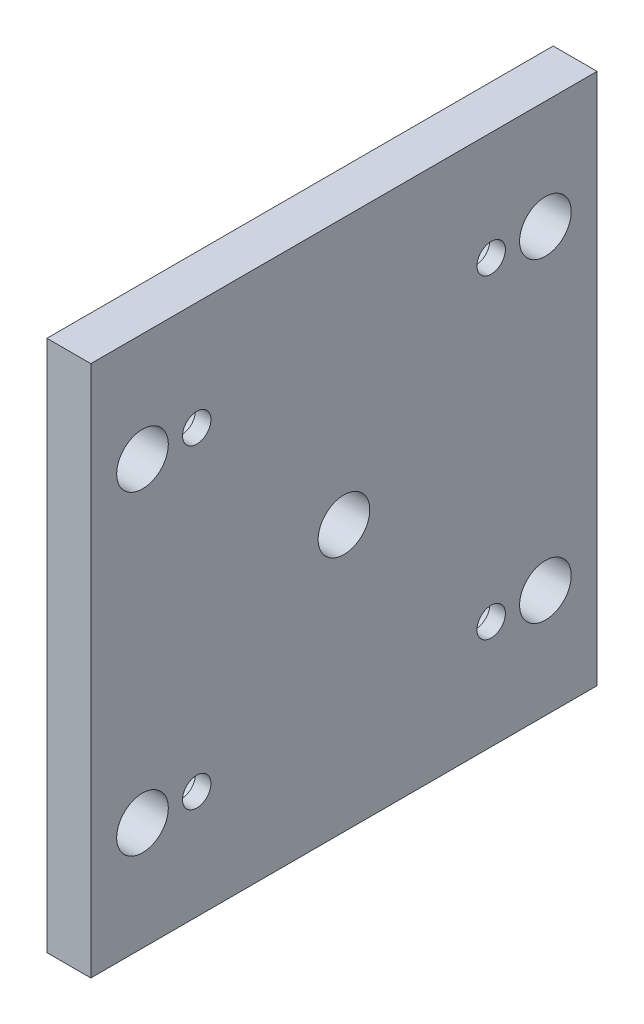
ISO-10303-21;
HEADER;
FILE_DESCRIPTION(('STEP AP214'),'2;1');
FILE_NAME('part.step','',(''),(''),'','','');
FILE_SCHEMA(('AUTOMOTIVE_DESIGN { 1 0 10303 214 1 1 1 1 }'));
ENDSEC;
DATA;
#1=APPLICATION_CONTEXT('core data for automotive mechanical design processes');
#2=APPLICATION_PROTOCOL_DEFINITION('international standard','automotive_design',2000,#1);
#3=PRODUCT_CONTEXT('',#1,'mechanical');
#4=PRODUCT('Part','Part','',(#3));
#5=PRODUCT_RELATED_PRODUCT_CATEGORY('part','',(#4));
#6=PRODUCT_DEFINITION_FORMATION('','',#4);
#7=PRODUCT_DEFINITION_CONTEXT('part definition',#1,'design');
#8=PRODUCT_DEFINITION('design','',#6,#7);
#9=PRODUCT_DEFINITION_SHAPE('','',#8);
#10=(LENGTH_UNIT() NAMED_UNIT(*) SI_UNIT(.MILLI.,.METRE.));
#11=(NAMED_UNIT(*) PLANE_ANGLE_UNIT() SI_UNIT($,.RADIAN.));
#12=(NAMED_UNIT(*) SI_UNIT($,.STERADIAN.) SOLID_ANGLE_UNIT());
#13=UNCERTAINTY_MEASURE_WITH_UNIT(LENGTH_MEASURE(1.E-05),#10,'distance_accuracy_value','');
#14=(GEOMETRIC_REPRESENTATION_CONTEXT(3) GLOBAL_UNCERTAINTY_ASSIGNED_CONTEXT((#13)) GLOBAL_UNIT_ASSIGNED_CONTEXT((#10,
#11,#12)) REPRESENTATION_CONTEXT('',''));
#15=CARTESIAN_POINT('',(0.,0.,0.));
#16=DIRECTION('',(0.,0.,1.));
#17=DIRECTION('',(1.,0.,0.));
#18=AXIS2_PLACEMENT_3D('',#15,#16,#17);
#19=CARTESIAN_POINT('',(-165.,78.,98.0000000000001));
#20=DIRECTION('',(-1.,0.,0.));
#21=DIRECTION('',(0.,0.,1.));
#22=AXIS2_PLACEMENT_3D('',#19,#20,#21);
#23=PLANE('',#22);
#24=CARTESIAN_POINT('',(-165.,78.,98.0000000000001));
#25=DIRECTION('',(-1.,0.,0.));
#26=DIRECTION('',(0.,0.,1.));
#27=AXIS2_PLACEMENT_3D('',#24,#25,#26);
#28=CIRCLE('',#27,9.99999999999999);
#29=CARTESIAN_POINT('',(-165.,78.,108.));
#30=VERTEX_POINT('',#29);
#31=EDGE_CURVE('E100',#30,#30,#28,.T.);
#32=ORIENTED_EDGE('',*,*,#31,.F.);
#33=EDGE_LOOP('',(#32));
#34=FACE_BOUND('',#33,.T.);
#35=CARTESIAN_POINT('',(-165.,139.,155.));
#36=DIRECTION('',(-1.,0.,0.));
#37=DIRECTION('',(0.,0.,1.));
#38=AXIS2_PLACEMENT_3D('',#35,#36,#37);
#39=CIRCLE('',#38,9.);
#40=CARTESIAN_POINT('',(-165.,139.,164.));
#41=VERTEX_POINT('',#40);
#42=EDGE_CURVE('E31',#41,#41,#39,.T.);
#43=ORIENTED_EDGE('',*,*,#42,.F.);
#44=EDGE_LOOP('',(#43));
#45=FACE_BOUND('',#44,.T.);
#46=CARTESIAN_POINT('',(-165.,139.,41.0000000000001));
#47=DIRECTION('',(-1.,0.,0.));
#48=DIRECTION('',(0.,0.,1.));
#49=AXIS2_PLACEMENT_3D('',#46,#47,#48);
#50=CIRCLE('',#49,9.);
#51=CARTESIAN_POINT('',(-165.,139.,50.0000000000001));
#52=VERTEX_POINT('',#51);
#53=EDGE_CURVE('E127',#52,#52,#50,.T.);
#54=ORIENTED_EDGE('',*,*,#53,.F.);
#55=EDGE_LOOP('',(#54));
#56=FACE_BOUND('',#55,.T.);
#57=CARTESIAN_POINT('',(-165.,17.,155.));
#58=DIRECTION('',(-1.,0.,0.));
#59=DIRECTION('',(0.,0.,1.));
#60=AXIS2_PLACEMENT_3D('',#57,#58,#59);
#61=CIRCLE('',#60,9.);
#62=CARTESIAN_POINT('',(-165.,17.,164.));
#63=VERTEX_POINT('',#62);
#64=EDGE_CURVE('E135',#63,#63,#61,.T.);
#65=ORIENTED_EDGE('',*,*,#64,.F.);
#66=EDGE_LOOP('',(#65));
#67=FACE_BOUND('',#66,.T.);
#68=CARTESIAN_POINT('',(-165.,17.,41.));
#69=DIRECTION('',(-1.,0.,0.));
#70=DIRECTION('',(0.,0.,1.));
#71=AXIS2_PLACEMENT_3D('',#68,#69,#70);
#72=CIRCLE('',#71,9.);
#73=CARTESIAN_POINT('',(-165.,17.,50.));
#74=VERTEX_POINT('',#73);
#75=EDGE_CURVE('E162',#74,#74,#72,.T.);
#76=ORIENTED_EDGE('',*,*,#75,.F.);
#77=EDGE_LOOP('',(#76));
#78=FACE_BOUND('',#77,.T.);
#79=CARTESIAN_POINT('',(-165.,139.,176.));
#80=DIRECTION('',(-1.,0.,0.));
#81=DIRECTION('',(0.,0.,1.));
#82=AXIS2_PLACEMENT_3D('',#79,#80,#81);
#83=CIRCLE('',#82,10.);
#84=CARTESIAN_POINT('',(-165.,139.,186.));
#85=VERTEX_POINT('',#84);
#86=EDGE_CURVE('E136',#85,#85,#83,.T.);
#87=ORIENTED_EDGE('',*,*,#86,.F.);
#88=EDGE_LOOP('',(#87));
#89=FACE_BOUND('',#88,.T.);
#90=CARTESIAN_POINT('',(-165.,139.,20.0000000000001));
#91=DIRECTION('',(-1.,0.,0.));
#92=DIRECTION('',(0.,0.,1.));
#93=AXIS2_PLACEMENT_3D('',#90,#91,#92);
#94=CIRCLE('',#93,10.);
#95=CARTESIAN_POINT('',(-165.,139.,30.0000000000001));
#96=VERTEX_POINT('',#95);
#97=EDGE_CURVE('E141',#96,#96,#94,.T.);
#98=ORIENTED_EDGE('',*,*,#97,.F.);
#99=EDGE_LOOP('',(#98));
#100=FACE_BOUND('',#99,.T.);
#101=CARTESIAN_POINT('',(-165.,17.,176.));
#102=DIRECTION('',(-1.,0.,0.));
#103=DIRECTION('',(0.,0.,1.));
#104=AXIS2_PLACEMENT_3D('',#101,#102,#103);
#105=CIRCLE('',#104,10.);
#106=CARTESIAN_POINT('',(-165.,17.,186.));
#107=VERTEX_POINT('',#106);
#108=EDGE_CURVE('E145',#107,#107,#105,.T.);
#109=ORIENTED_EDGE('',*,*,#108,.F.);
#110=EDGE_LOOP('',(#109));
#111=FACE_BOUND('',#110,.T.);
#112=CARTESIAN_POINT('',(-165.,17.,20.));
#113=DIRECTION('',(-1.,0.,0.));
#114=DIRECTION('',(0.,0.,1.));
#115=AXIS2_PLACEMENT_3D('',#112,#113,#114);
#116=CIRCLE('',#115,10.);
#117=CARTESIAN_POINT('',(-165.,17.,30.));
#118=VERTEX_POINT('',#117);
#119=EDGE_CURVE('E149',#118,#118,#116,.T.);
#120=ORIENTED_EDGE('',*,*,#119,.F.);
#121=EDGE_LOOP('',(#120));
#122=FACE_BOUND('',#121,.T.);
#123=DIRECTION('',(0.,1.,0.));
#124=VECTOR('',#123,1.);
#125=CARTESIAN_POINT('',(-165.,78.,0.));
#126=LINE('',#125,#124);
#127=CARTESIAN_POINT('',(-165.,-25.,0.));
#128=VERTEX_POINT('',#127);
#129=CARTESIAN_POINT('',(-165.,181.,0.));
#130=VERTEX_POINT('',#129);
#131=EDGE_CURVE('E11',#128,#130,#126,.T.);
#132=ORIENTED_EDGE('',*,*,#131,.F.);
#133=DIRECTION('',(0.,0.,-1.));
#134=VECTOR('',#133,1.);
#135=CARTESIAN_POINT('',(-165.,-25.0000000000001,196.));
#136=LINE('',#135,#134);
#137=CARTESIAN_POINT('',(-165.,-25.0000000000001,196.));
#138=VERTEX_POINT('',#137);
#139=EDGE_CURVE('E82',#138,#128,#136,.T.);
#140=ORIENTED_EDGE('',*,*,#139,.F.);
#141=DIRECTION('',(0.,-1.,0.));
#142=VECTOR('',#141,1.);
#143=CARTESIAN_POINT('',(-165.,78.,196.));
#144=LINE('',#143,#142);
#145=CARTESIAN_POINT('',(-165.,181.,196.));
#146=VERTEX_POINT('',#145);
#147=EDGE_CURVE('E36',#146,#138,#144,.T.);
#148=ORIENTED_EDGE('',*,*,#147,.F.);
#149=DIRECTION('',(0.,0.,1.));
#150=VECTOR('',#149,1.);
#151=CARTESIAN_POINT('',(-165.,181.,0.));
#152=LINE('',#151,#150);
#153=EDGE_CURVE('E96',#130,#146,#152,.T.);
#154=ORIENTED_EDGE('',*,*,#153,.F.);
#155=EDGE_LOOP('',(#132,#140,#148,#154));
#156=FACE_BOUND('',#155,.T.);
#157=ADVANCED_FACE('F28',(#34,#45,#56,#67,#78,#89,#100,#111,#122,#156),#23,.T.);
#158=CARTESIAN_POINT('',(-148.,78.,0.));
#159=DIRECTION('',(0.,0.,-1.));
#160=DIRECTION('',(-1.,0.,0.));
#161=AXIS2_PLACEMENT_3D('',#158,#159,#160);
#162=PLANE('',#161);
#163=DIRECTION('',(0.,-1.,0.));
#164=VECTOR('',#163,1.);
#165=CARTESIAN_POINT('',(-148.,78.,0.));
#166=LINE('',#165,#164);
#167=CARTESIAN_POINT('',(-148.,181.,0.));
#168=VERTEX_POINT('',#167);
#169=CARTESIAN_POINT('',(-148.,-25.,0.));
#170=VERTEX_POINT('',#169);
#171=EDGE_CURVE('E75',#168,#170,#166,.T.);
#172=ORIENTED_EDGE('',*,*,#171,.T.);
#173=DIRECTION('',(1.,0.,0.));
#174=VECTOR('',#173,1.);
#175=CARTESIAN_POINT('',(-165.,-25.,0.));
#176=LINE('',#175,#174);
#177=EDGE_CURVE('E87',#128,#170,#176,.T.);
#178=ORIENTED_EDGE('',*,*,#177,.F.);
#179=ORIENTED_EDGE('',*,*,#131,.T.);
#180=DIRECTION('',(-1.,0.,0.));
#181=VECTOR('',#180,1.);
#182=CARTESIAN_POINT('',(-148.,181.,0.));
#183=LINE('',#182,#181);
#184=EDGE_CURVE('E93',#168,#130,#183,.T.);
#185=ORIENTED_EDGE('',*,*,#184,.F.);
#186=EDGE_LOOP('',(#172,#178,#179,#185));
#187=FACE_BOUND('',#186,.T.);
#188=ADVANCED_FACE('F185',(#187),#162,.T.);
#189=CARTESIAN_POINT('',(-148.,78.,98.));
#190=DIRECTION('',(1.,0.,0.));
#191=DIRECTION('',(0.,0.,-1.));
#192=AXIS2_PLACEMENT_3D('',#189,#190,#191);
#193=PLANE('',#192);
#194=CARTESIAN_POINT('',(-148.,78.,98.));
#195=DIRECTION('',(-1.,0.,0.));
#196=DIRECTION('',(0.,0.,1.));
#197=AXIS2_PLACEMENT_3D('',#194,#195,#196);
#198=CIRCLE('',#197,9.99999999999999);
#199=CARTESIAN_POINT('',(-148.,78.,108.));
#200=VERTEX_POINT('',#199);
#201=EDGE_CURVE('E103',#200,#200,#198,.T.);
#202=ORIENTED_EDGE('',*,*,#201,.T.);
#203=EDGE_LOOP('',(#202));
#204=FACE_BOUND('',#203,.T.);
#205=CARTESIAN_POINT('',(-148.,139.,155.));
#206=DIRECTION('',(1.,0.,0.));
#207=DIRECTION('',(0.,0.,-1.));
#208=AXIS2_PLACEMENT_3D('',#205,#206,#207);
#209=CIRCLE('',#208,5.5);
#210=CARTESIAN_POINT('',(-148.,139.,149.5));
#211=VERTEX_POINT('',#210);
#212=EDGE_CURVE('E110',#211,#211,#209,.T.);
#213=ORIENTED_EDGE('',*,*,#212,.F.);
#214=EDGE_LOOP('',(#213));
#215=FACE_BOUND('',#214,.T.);
#216=CARTESIAN_POINT('',(-148.,139.,41.));
#217=DIRECTION('',(1.,0.,0.));
#218=DIRECTION('',(0.,0.,-1.));
#219=AXIS2_PLACEMENT_3D('',#216,#217,#218);
#220=CIRCLE('',#219,5.5);
#221=CARTESIAN_POINT('',(-148.,139.,35.5));
#222=VERTEX_POINT('',#221);
#223=EDGE_CURVE('E116',#222,#222,#220,.T.);
#224=ORIENTED_EDGE('',*,*,#223,.F.);
#225=EDGE_LOOP('',(#224));
#226=FACE_BOUND('',#225,.T.);
#227=CARTESIAN_POINT('',(-148.,17.,155.));
#228=DIRECTION('',(1.,0.,0.));
#229=DIRECTION('',(0.,0.,-1.));
#230=AXIS2_PLACEMENT_3D('',#227,#228,#229);
#231=CIRCLE('',#230,5.5);
#232=CARTESIAN_POINT('',(-148.,17.,149.5));
#233=VERTEX_POINT('',#232);
#234=EDGE_CURVE('E123',#233,#233,#231,.T.);
#235=ORIENTED_EDGE('',*,*,#234,.F.);
#236=EDGE_LOOP('',(#235));
#237=FACE_BOUND('',#236,.T.);
#238=CARTESIAN_POINT('',(-148.,17.,41.));
#239=DIRECTION('',(1.,0.,0.));
#240=DIRECTION('',(0.,0.,-1.));
#241=AXIS2_PLACEMENT_3D('',#238,#239,#240);
#242=CIRCLE('',#241,5.5);
#243=CARTESIAN_POINT('',(-148.,17.,35.5));
#244=VERTEX_POINT('',#243);
#245=EDGE_CURVE('E131',#244,#244,#242,.T.);
#246=ORIENTED_EDGE('',*,*,#245,.F.);
#247=EDGE_LOOP('',(#246));
#248=FACE_BOUND('',#247,.T.);
#249=CARTESIAN_POINT('',(-148.,139.,176.));
#250=DIRECTION('',(1.,0.,0.));
#251=DIRECTION('',(0.,0.,-1.));
#252=AXIS2_PLACEMENT_3D('',#249,#250,#251);
#253=CIRCLE('',#252,10.);
#254=CARTESIAN_POINT('',(-148.,139.,166.));
#255=VERTEX_POINT('',#254);
#256=EDGE_CURVE('E140',#255,#255,#253,.T.);
#257=ORIENTED_EDGE('',*,*,#256,.F.);
#258=EDGE_LOOP('',(#257));
#259=FACE_BOUND('',#258,.T.);
#260=CARTESIAN_POINT('',(-148.,139.,20.0000000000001));
#261=DIRECTION('',(1.,0.,0.));
#262=DIRECTION('',(0.,0.,-1.));
#263=AXIS2_PLACEMENT_3D('',#260,#261,#262);
#264=CIRCLE('',#263,10.);
#265=CARTESIAN_POINT('',(-148.,139.,10.0000000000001));
#266=VERTEX_POINT('',#265);
#267=EDGE_CURVE('E139',#266,#266,#264,.T.);
#268=ORIENTED_EDGE('',*,*,#267,.F.);
#269=EDGE_LOOP('',(#268));
#270=FACE_BOUND('',#269,.T.);
#271=CARTESIAN_POINT('',(-148.,17.,176.));
#272=DIRECTION('',(1.,0.,0.));
#273=DIRECTION('',(0.,0.,-1.));
#274=AXIS2_PLACEMENT_3D('',#271,#272,#273);
#275=CIRCLE('',#274,10.);
#276=CARTESIAN_POINT('',(-148.,17.,166.));
#277=VERTEX_POINT('',#276);
#278=EDGE_CURVE('E144',#277,#277,#275,.T.);
#279=ORIENTED_EDGE('',*,*,#278,.F.);
#280=EDGE_LOOP('',(#279));
#281=FACE_BOUND('',#280,.T.);
#282=CARTESIAN_POINT('',(-148.,17.,20.));
#283=DIRECTION('',(1.,0.,0.));
#284=DIRECTION('',(0.,0.,-1.));
#285=AXIS2_PLACEMENT_3D('',#282,#283,#284);
#286=CIRCLE('',#285,10.);
#287=CARTESIAN_POINT('',(-148.,17.,9.99999999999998));
#288=VERTEX_POINT('',#287);
#289=EDGE_CURVE('E148',#288,#288,#286,.T.);
#290=ORIENTED_EDGE('',*,*,#289,.F.);
#291=EDGE_LOOP('',(#290));
#292=FACE_BOUND('',#291,.T.);
#293=DIRECTION('',(0.,1.,0.));
#294=VECTOR('',#293,1.);
#295=CARTESIAN_POINT('',(-148.,78.,196.));
#296=LINE('',#295,#294);
#297=CARTESIAN_POINT('',(-148.,-25.0000000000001,196.));
#298=VERTEX_POINT('',#297);
#299=CARTESIAN_POINT('',(-148.,181.,196.));
#300=VERTEX_POINT('',#299);
#301=EDGE_CURVE('E44',#298,#300,#296,.T.);
#302=ORIENTED_EDGE('',*,*,#301,.F.);
#303=DIRECTION('',(0.,0.,1.));
#304=VECTOR('',#303,1.);
#305=CARTESIAN_POINT('',(-148.,-25.,0.));
#306=LINE('',#305,#304);
#307=EDGE_CURVE('E72',#170,#298,#306,.T.);
#308=ORIENTED_EDGE('',*,*,#307,.F.);
#309=ORIENTED_EDGE('',*,*,#171,.F.);
#310=DIRECTION('',(0.,0.,-1.));
#311=VECTOR('',#310,1.);
#312=CARTESIAN_POINT('',(-148.,181.,196.));
#313=LINE('',#312,#311);
#314=EDGE_CURVE('E74',#300,#168,#313,.T.);
#315=ORIENTED_EDGE('',*,*,#314,.F.);
#316=EDGE_LOOP('',(#302,#308,#309,#315));
#317=FACE_BOUND('',#316,.T.);
#318=ADVANCED_FACE('F70',(#204,#215,#226,#237,#248,#259,#270,#281,#292,#317),#193,.T.);
#319=CARTESIAN_POINT('',(-148.,78.,196.));
#320=DIRECTION('',(0.,0.,1.));
#321=DIRECTION('',(1.,0.,0.));
#322=AXIS2_PLACEMENT_3D('',#319,#320,#321);
#323=PLANE('',#322);
#324=ORIENTED_EDGE('',*,*,#301,.T.);
#325=DIRECTION('',(1.,0.,0.));
#326=VECTOR('',#325,1.);
#327=CARTESIAN_POINT('',(-165.,181.,196.));
#328=LINE('',#327,#326);
#329=EDGE_CURVE('E98',#146,#300,#328,.T.);
#330=ORIENTED_EDGE('',*,*,#329,.F.);
#331=ORIENTED_EDGE('',*,*,#147,.T.);
#332=DIRECTION('',(-1.,0.,0.));
#333=VECTOR('',#332,1.);
#334=CARTESIAN_POINT('',(-148.,-25.0000000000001,196.));
#335=LINE('',#334,#333);
#336=EDGE_CURVE('E78',#298,#138,#335,.T.);
#337=ORIENTED_EDGE('',*,*,#336,.F.);
#338=EDGE_LOOP('',(#324,#330,#331,#337));
#339=FACE_BOUND('',#338,.T.);
#340=ADVANCED_FACE('F79',(#339),#323,.T.);
#341=CARTESIAN_POINT('',(3.,16.9999999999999,20.));
#342=DIRECTION('',(-1.,0.,0.));
#343=DIRECTION('',(0.,1.,0.));
#344=AXIS2_PLACEMENT_3D('',#341,#342,#343);
#345=CYLINDRICAL_SURFACE('',#344,10.);
#346=ORIENTED_EDGE('',*,*,#119,.T.);
#347=EDGE_LOOP('',(#346));
#348=FACE_BOUND('',#347,.T.);
#349=ORIENTED_EDGE('',*,*,#289,.T.);
#350=EDGE_LOOP('',(#349));
#351=FACE_BOUND('',#350,.T.);
#352=ADVANCED_FACE('F271',(#348,#351),#345,.F.);
#353=CARTESIAN_POINT('',(3.,17.,176.));
#354=DIRECTION('',(-1.,0.,0.));
#355=DIRECTION('',(0.,1.,0.));
#356=AXIS2_PLACEMENT_3D('',#353,#354,#355);
#357=CYLINDRICAL_SURFACE('',#356,10.);
#358=ORIENTED_EDGE('',*,*,#108,.T.);
#359=EDGE_LOOP('',(#358));
#360=FACE_BOUND('',#359,.T.);
#361=ORIENTED_EDGE('',*,*,#278,.T.);
#362=EDGE_LOOP('',(#361));
#363=FACE_BOUND('',#362,.T.);
#364=ADVANCED_FACE('F267',(#360,#363),#357,.F.);
#365=CARTESIAN_POINT('',(3.00000000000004,139.,20.));
#366=DIRECTION('',(-1.,0.,0.));
#367=DIRECTION('',(0.,1.,0.));
#368=AXIS2_PLACEMENT_3D('',#365,#366,#367);
#369=CYLINDRICAL_SURFACE('',#368,10.);
#370=ORIENTED_EDGE('',*,*,#97,.T.);
#371=EDGE_LOOP('',(#370));
#372=FACE_BOUND('',#371,.T.);
#373=ORIENTED_EDGE('',*,*,#267,.T.);
#374=EDGE_LOOP('',(#373));
#375=FACE_BOUND('',#374,.T.);
#376=ADVANCED_FACE('F263',(#372,#375),#369,.F.);
#377=CARTESIAN_POINT('',(3.,139.,176.));
#378=DIRECTION('',(-1.,0.,0.));
#379=DIRECTION('',(0.,1.,0.));
#380=AXIS2_PLACEMENT_3D('',#377,#378,#379);
#381=CYLINDRICAL_SURFACE('',#380,10.);
#382=ORIENTED_EDGE('',*,*,#86,.T.);
#383=EDGE_LOOP('',(#382));
#384=FACE_BOUND('',#383,.T.);
#385=ORIENTED_EDGE('',*,*,#256,.T.);
#386=EDGE_LOOP('',(#385));
#387=FACE_BOUND('',#386,.T.);
#388=ADVANCED_FACE('F256',(#384,#387),#381,.F.);
#389=CARTESIAN_POINT('',(-154.,17.,41.));
#390=DIRECTION('',(1.,0.,0.));
#391=DIRECTION('',(0.,0.,-1.));
#392=AXIS2_PLACEMENT_3D('',#389,#390,#391);
#393=PLANE('',#392);
#394=CARTESIAN_POINT('',(-154.,17.,41.));
#395=DIRECTION('',(1.,0.,0.));
#396=DIRECTION('',(0.,0.,-1.));
#397=AXIS2_PLACEMENT_3D('',#394,#395,#396);
#398=CIRCLE('',#397,5.5);
#399=CARTESIAN_POINT('',(-154.,17.,35.5));
#400=VERTEX_POINT('',#399);
#401=EDGE_CURVE('E128',#400,#400,#398,.T.);
#402=ORIENTED_EDGE('',*,*,#401,.T.);
#403=EDGE_LOOP('',(#402));
#404=FACE_BOUND('',#403,.T.);
#405=CARTESIAN_POINT('',(-154.,17.,41.));
#406=DIRECTION('',(-1.,0.,0.));
#407=DIRECTION('',(0.,-1.,0.));
#408=AXIS2_PLACEMENT_3D('',#405,#406,#407);
#409=CIRCLE('',#408,9.);
#410=CARTESIAN_POINT('',(-154.,8.,41.));
#411=VERTEX_POINT('',#410);
#412=EDGE_CURVE('E132',#411,#411,#409,.T.);
#413=ORIENTED_EDGE('',*,*,#412,.T.);
#414=EDGE_LOOP('',(#413));
#415=FACE_BOUND('',#414,.T.);
#416=ADVANCED_FACE('F253',(#404,#415),#393,.F.);
#417=CARTESIAN_POINT('',(-166.,17.,41.));
#418=DIRECTION('',(1.,0.,0.));
#419=DIRECTION('',(0.,-1.,0.));
#420=AXIS2_PLACEMENT_3D('',#417,#418,#419);
#421=CYLINDRICAL_SURFACE('',#420,9.);
#422=ORIENTED_EDGE('',*,*,#75,.T.);
#423=EDGE_LOOP('',(#422));
#424=FACE_BOUND('',#423,.T.);
#425=ORIENTED_EDGE('',*,*,#412,.F.);
#426=EDGE_LOOP('',(#425));
#427=FACE_BOUND('',#426,.T.);
#428=ADVANCED_FACE('F251',(#424,#427),#421,.F.);
#429=CARTESIAN_POINT('',(-166.,17.,41.));
#430=DIRECTION('',(1.,0.,0.));
#431=DIRECTION('',(0.,-1.,0.));
#432=AXIS2_PLACEMENT_3D('',#429,#430,#431);
#433=CYLINDRICAL_SURFACE('',#432,5.5);
#434=ORIENTED_EDGE('',*,*,#245,.T.);
#435=EDGE_LOOP('',(#434));
#436=FACE_BOUND('',#435,.T.);
#437=ORIENTED_EDGE('',*,*,#401,.F.);
#438=EDGE_LOOP('',(#437));
#439=FACE_BOUND('',#438,.T.);
#440=ADVANCED_FACE('F244',(#436,#439),#433,.F.);
#441=CARTESIAN_POINT('',(-154.,17.,155.));
#442=DIRECTION('',(1.,0.,0.));
#443=DIRECTION('',(0.,0.,-1.));
#444=AXIS2_PLACEMENT_3D('',#441,#442,#443);
#445=PLANE('',#444);
#446=CARTESIAN_POINT('',(-154.,17.,155.));
#447=DIRECTION('',(1.,0.,0.));
#448=DIRECTION('',(0.,0.,-1.));
#449=AXIS2_PLACEMENT_3D('',#446,#447,#448);
#450=CIRCLE('',#449,5.5);
#451=CARTESIAN_POINT('',(-154.,17.,149.5));
#452=VERTEX_POINT('',#451);
#453=EDGE_CURVE('E120',#452,#452,#450,.T.);
#454=ORIENTED_EDGE('',*,*,#453,.T.);
#455=EDGE_LOOP('',(#454));
#456=FACE_BOUND('',#455,.T.);
#457=CARTESIAN_POINT('',(-154.,17.,155.));
#458=DIRECTION('',(-1.,0.,0.));
#459=DIRECTION('',(0.,-1.,0.));
#460=AXIS2_PLACEMENT_3D('',#457,#458,#459);
#461=CIRCLE('',#460,9.);
#462=CARTESIAN_POINT('',(-154.,7.99999999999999,155.));
#463=VERTEX_POINT('',#462);
#464=EDGE_CURVE('E124',#463,#463,#461,.T.);
#465=ORIENTED_EDGE('',*,*,#464,.T.);
#466=EDGE_LOOP('',(#465));
#467=FACE_BOUND('',#466,.T.);
#468=ADVANCED_FACE('F241',(#456,#467),#445,.F.);
#469=CARTESIAN_POINT('',(-166.,17.,155.));
#470=DIRECTION('',(1.,0.,0.));
#471=DIRECTION('',(0.,-1.,0.));
#472=AXIS2_PLACEMENT_3D('',#469,#470,#471);
#473=CYLINDRICAL_SURFACE('',#472,9.);
#474=ORIENTED_EDGE('',*,*,#64,.T.);
#475=EDGE_LOOP('',(#474));
#476=FACE_BOUND('',#475,.T.);
#477=ORIENTED_EDGE('',*,*,#464,.F.);
#478=EDGE_LOOP('',(#477));
#479=FACE_BOUND('',#478,.T.);
#480=ADVANCED_FACE('F239',(#476,#479),#473,.F.);
#481=CARTESIAN_POINT('',(-166.,17.,155.));
#482=DIRECTION('',(1.,0.,0.));
#483=DIRECTION('',(0.,-1.,0.));
#484=AXIS2_PLACEMENT_3D('',#481,#482,#483);
#485=CYLINDRICAL_SURFACE('',#484,5.5);
#486=ORIENTED_EDGE('',*,*,#234,.T.);
#487=EDGE_LOOP('',(#486));
#488=FACE_BOUND('',#487,.T.);
#489=ORIENTED_EDGE('',*,*,#453,.F.);
#490=EDGE_LOOP('',(#489));
#491=FACE_BOUND('',#490,.T.);
#492=ADVANCED_FACE('F232',(#488,#491),#485,.F.);
#493=CARTESIAN_POINT('',(-154.,139.,41.));
#494=DIRECTION('',(1.,0.,0.));
#495=DIRECTION('',(0.,0.,-1.));
#496=AXIS2_PLACEMENT_3D('',#493,#494,#495);
#497=PLANE('',#496);
#498=CARTESIAN_POINT('',(-154.,139.,41.));
#499=DIRECTION('',(1.,0.,0.));
#500=DIRECTION('',(0.,0.,-1.));
#501=AXIS2_PLACEMENT_3D('',#498,#499,#500);
#502=CIRCLE('',#501,5.5);
#503=CARTESIAN_POINT('',(-154.,139.,35.5));
#504=VERTEX_POINT('',#503);
#505=EDGE_CURVE('E113',#504,#504,#502,.T.);
#506=ORIENTED_EDGE('',*,*,#505,.T.);
#507=EDGE_LOOP('',(#506));
#508=FACE_BOUND('',#507,.T.);
#509=CARTESIAN_POINT('',(-154.,139.,41.));
#510=DIRECTION('',(-1.,0.,0.));
#511=DIRECTION('',(0.,-1.,0.));
#512=AXIS2_PLACEMENT_3D('',#509,#510,#511);
#513=CIRCLE('',#512,9.);
#514=CARTESIAN_POINT('',(-154.,130.,41.));
#515=VERTEX_POINT('',#514);
#516=EDGE_CURVE('E117',#515,#515,#513,.T.);
#517=ORIENTED_EDGE('',*,*,#516,.T.);
#518=EDGE_LOOP('',(#517));
#519=FACE_BOUND('',#518,.T.);
#520=ADVANCED_FACE('F229',(#508,#519),#497,.F.);
#521=CARTESIAN_POINT('',(-166.,139.,41.0000000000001));
#522=DIRECTION('',(1.,0.,0.));
#523=DIRECTION('',(0.,-1.,0.));
#524=AXIS2_PLACEMENT_3D('',#521,#522,#523);
#525=CYLINDRICAL_SURFACE('',#524,9.);
#526=ORIENTED_EDGE('',*,*,#53,.T.);
#527=EDGE_LOOP('',(#526));
#528=FACE_BOUND('',#527,.T.);
#529=ORIENTED_EDGE('',*,*,#516,.F.);
#530=EDGE_LOOP('',(#529));
#531=FACE_BOUND('',#530,.T.);
#532=ADVANCED_FACE('F227',(#528,#531),#525,.F.);
#533=CARTESIAN_POINT('',(-166.,139.,41.0000000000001));
#534=DIRECTION('',(1.,0.,0.));
#535=DIRECTION('',(0.,-1.,0.));
#536=AXIS2_PLACEMENT_3D('',#533,#534,#535);
#537=CYLINDRICAL_SURFACE('',#536,5.5);
#538=ORIENTED_EDGE('',*,*,#223,.T.);
#539=EDGE_LOOP('',(#538));
#540=FACE_BOUND('',#539,.T.);
#541=ORIENTED_EDGE('',*,*,#505,.F.);
#542=EDGE_LOOP('',(#541));
#543=FACE_BOUND('',#542,.T.);
#544=ADVANCED_FACE('F221',(#540,#543),#537,.F.);
#545=CARTESIAN_POINT('',(-154.,139.,155.));
#546=DIRECTION('',(1.,0.,0.));
#547=DIRECTION('',(0.,0.,-1.));
#548=AXIS2_PLACEMENT_3D('',#545,#546,#547);
#549=PLANE('',#548);
#550=CARTESIAN_POINT('',(-154.,139.,155.));
#551=DIRECTION('',(1.,0.,0.));
#552=DIRECTION('',(0.,0.,-1.));
#553=AXIS2_PLACEMENT_3D('',#550,#551,#552);
#554=CIRCLE('',#553,5.5);
#555=CARTESIAN_POINT('',(-154.,139.,149.5));
#556=VERTEX_POINT('',#555);
#557=EDGE_CURVE('E107',#556,#556,#554,.T.);
#558=ORIENTED_EDGE('',*,*,#557,.T.);
#559=EDGE_LOOP('',(#558));
#560=FACE_BOUND('',#559,.T.);
#561=CARTESIAN_POINT('',(-154.,139.,155.));
#562=DIRECTION('',(-1.,0.,0.));
#563=DIRECTION('',(0.,-1.,0.));
#564=AXIS2_PLACEMENT_3D('',#561,#562,#563);
#565=CIRCLE('',#564,9.);
#566=CARTESIAN_POINT('',(-154.,130.,155.));
#567=VERTEX_POINT('',#566);
#568=EDGE_CURVE('E106',#567,#567,#565,.T.);
#569=ORIENTED_EDGE('',*,*,#568,.T.);
#570=EDGE_LOOP('',(#569));
#571=FACE_BOUND('',#570,.T.);
#572=ADVANCED_FACE('F218',(#560,#571),#549,.F.);
#573=CARTESIAN_POINT('',(-166.,139.,155.));
#574=DIRECTION('',(1.,0.,0.));
#575=DIRECTION('',(0.,-1.,0.));
#576=AXIS2_PLACEMENT_3D('',#573,#574,#575);
#577=CYLINDRICAL_SURFACE('',#576,9.);
#578=ORIENTED_EDGE('',*,*,#42,.T.);
#579=EDGE_LOOP('',(#578));
#580=FACE_BOUND('',#579,.T.);
#581=ORIENTED_EDGE('',*,*,#568,.F.);
#582=EDGE_LOOP('',(#581));
#583=FACE_BOUND('',#582,.T.);
#584=ADVANCED_FACE('F180',(#580,#583),#577,.F.);
#585=CARTESIAN_POINT('',(-166.,139.,155.));
#586=DIRECTION('',(1.,0.,0.));
#587=DIRECTION('',(0.,-1.,0.));
#588=AXIS2_PLACEMENT_3D('',#585,#586,#587);
#589=CYLINDRICAL_SURFACE('',#588,5.5);
#590=ORIENTED_EDGE('',*,*,#212,.T.);
#591=EDGE_LOOP('',(#590));
#592=FACE_BOUND('',#591,.T.);
#593=ORIENTED_EDGE('',*,*,#557,.F.);
#594=EDGE_LOOP('',(#593));
#595=FACE_BOUND('',#594,.T.);
#596=ADVANCED_FACE('F212',(#592,#595),#589,.F.);
#597=CARTESIAN_POINT('',(-148.,78.,98.));
#598=DIRECTION('',(-1.,0.,0.));
#599=DIRECTION('',(0.,0.,1.));
#600=AXIS2_PLACEMENT_3D('',#597,#598,#599);
#601=CYLINDRICAL_SURFACE('',#600,9.99999999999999);
#602=ORIENTED_EDGE('',*,*,#201,.F.);
#603=EDGE_LOOP('',(#602));
#604=FACE_BOUND('',#603,.T.);
#605=ORIENTED_EDGE('',*,*,#31,.T.);
#606=EDGE_LOOP('',(#605));
#607=FACE_BOUND('',#606,.T.);
#608=ADVANCED_FACE('F205',(#604,#607),#601,.F.);
#609=CARTESIAN_POINT('',(-148.,181.,196.));
#610=DIRECTION('',(0.,-1.,0.));
#611=DIRECTION('',(0.,0.,-1.));
#612=AXIS2_PLACEMENT_3D('',#609,#610,#611);
#613=PLANE('',#612);
#614=ORIENTED_EDGE('',*,*,#314,.T.);
#615=ORIENTED_EDGE('',*,*,#184,.T.);
#616=ORIENTED_EDGE('',*,*,#153,.T.);
#617=ORIENTED_EDGE('',*,*,#329,.T.);
#618=EDGE_LOOP('',(#614,#615,#616,#617));
#619=FACE_BOUND('',#618,.T.);
#620=ADVANCED_FACE('F203',(#619),#613,.F.);
#621=CARTESIAN_POINT('',(-148.,-25.0000000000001,196.));
#622=DIRECTION('',(0.,-1.,0.));
#623=DIRECTION('',(1.,0.,0.));
#624=AXIS2_PLACEMENT_3D('',#621,#622,#623);
#625=PLANE('',#624);
#626=ORIENTED_EDGE('',*,*,#307,.T.);
#627=ORIENTED_EDGE('',*,*,#336,.T.);
#628=ORIENTED_EDGE('',*,*,#139,.T.);
#629=ORIENTED_EDGE('',*,*,#177,.T.);
#630=EDGE_LOOP('',(#626,#627,#628,#629));
#631=FACE_BOUND('',#630,.T.);
#632=ADVANCED_FACE('F85',(#631),#625,.T.);
#633=CLOSED_SHELL('',(#157,#188,#318,#340,#352,#364,#376,#388,#416,#428,#440,#468,#480,#492,
#520,#532,#544,#572,#584,#596,#608,#620,#632));
#634=MANIFOLD_SOLID_BREP('B2',#633);
#635=ADVANCED_BREP_SHAPE_REPRESENTATION('',(#18,#634),#14);
#636=SHAPE_DEFINITION_REPRESENTATION(#9,#635);
ENDSEC;
END-ISO-10303-21;
